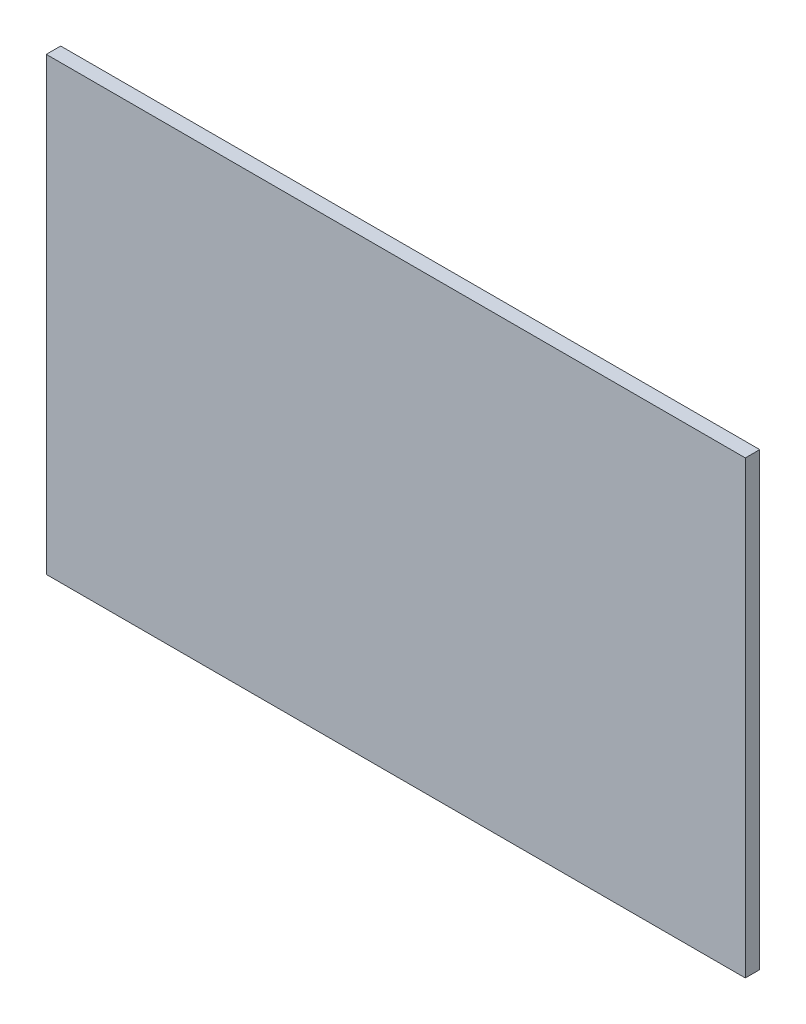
from build123d import *

# Parameters (mm, degrees)
SKIZZE1_W                       = 388
SKIZZE1_H                       = 250
AUFSATZ_LINEAR_AUSTRAGEN1_DEPTH = 8


with BuildPart() as part:
    # Skizze1 → Aufsatz-Linear austragen1 (new body)
    with BuildSketch(Plane.XY):
        Rectangle(SKIZZE1_W, SKIZZE1_H)
    extrude(amount=AUFSATZ_LINEAR_AUSTRAGEN1_DEPTH)


solid = part.part
